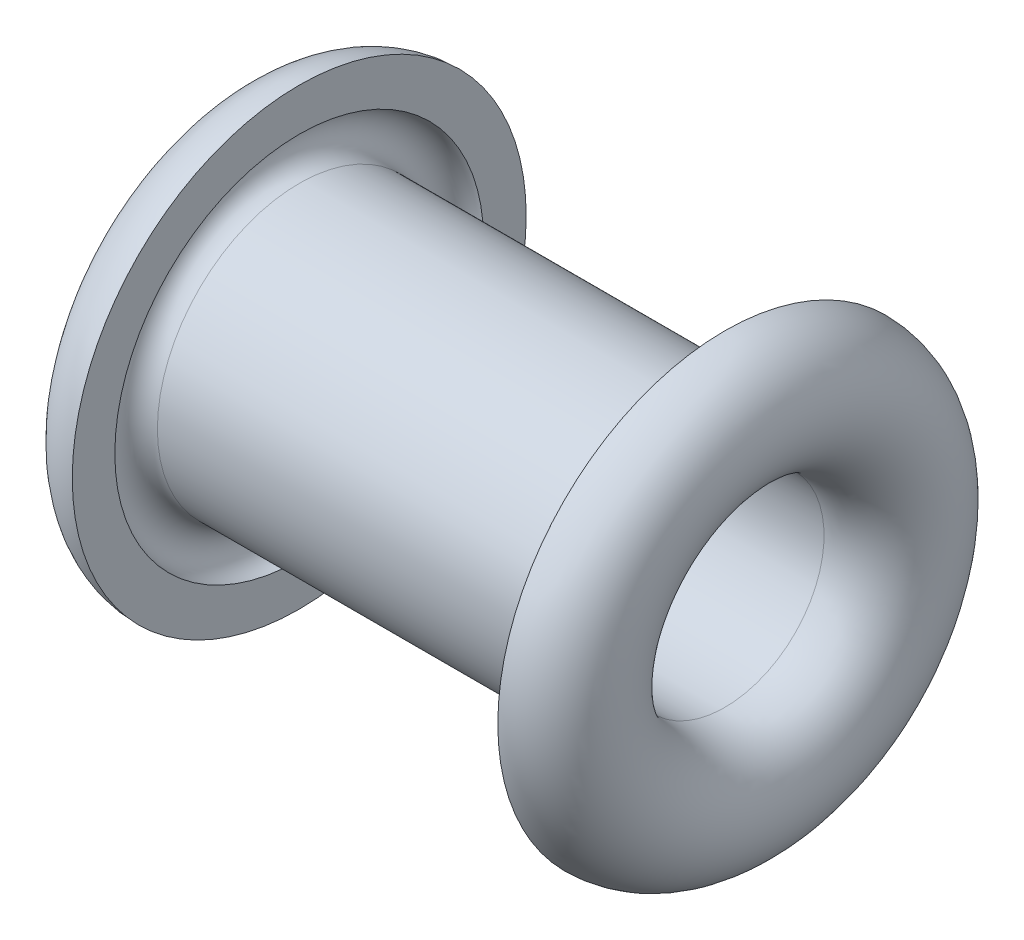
from build123d import *


with BuildPart() as part:
    # Esquisse1 → R_volution1 (revolve)
    with BuildSketch(Plane.XY, mode=Mode.PRIVATE) as r_volution1_sk:
        with BuildLine():
            Line((0, 0.7), (1.5, 0.7))
            Line((1.5, 0.7), (1.5, 1))
            Line((1.5, 1), (0, 1))
            ThreePointArc((0, 1), (-0.15, 1.15), (0, 1.3))
            Line((0, 1.3), (0, 1.6))
            ThreePointArc((0, 1.6), (-0.45, 1.15), (0, 0.7))
        make_face()
    revolve(r_volution1_sk.sketch.rotate(Axis((0, 0, 0), (1, 0, 0)), 90), axis=Axis((0, 0, 0), (1, 0, 0)))

    # Sym_trie1: part across plane


with BuildPart() as part_1:
    add(part.part)
    add(part.part.mirror(Plane(origin=(1.5, 1, 0), x_dir=(0, 0, 1), z_dir=(-1, 0, 0))))


solid = part_1.part
